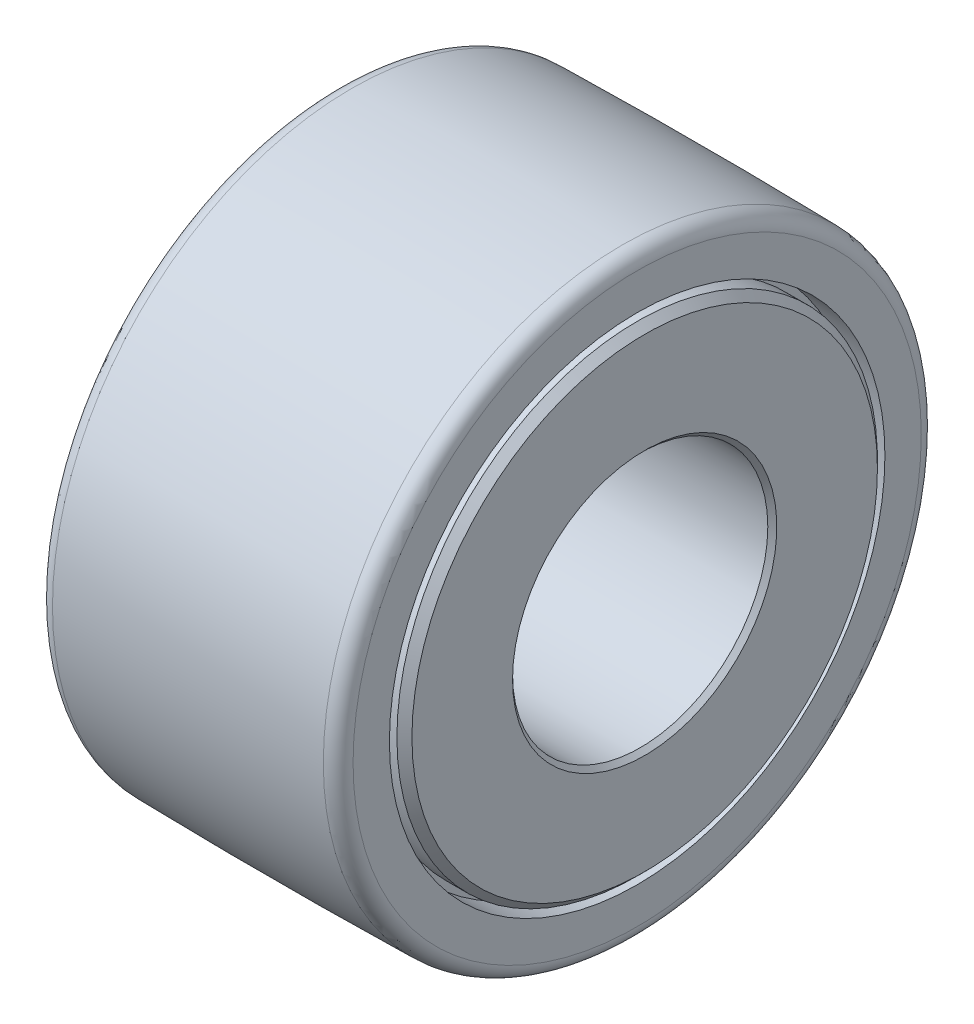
ISO-10303-21;
HEADER;
FILE_DESCRIPTION(('STEP AP214'),'2;1');
FILE_NAME('part.step','',(''),(''),'','','');
FILE_SCHEMA(('AUTOMOTIVE_DESIGN { 1 0 10303 214 1 1 1 1 }'));
ENDSEC;
DATA;
#1=APPLICATION_CONTEXT('core data for automotive mechanical design processes');
#2=APPLICATION_PROTOCOL_DEFINITION('international standard','automotive_design',2000,#1);
#3=PRODUCT_CONTEXT('',#1,'mechanical');
#4=PRODUCT('Part','Part','',(#3));
#5=PRODUCT_RELATED_PRODUCT_CATEGORY('part','',(#4));
#6=PRODUCT_DEFINITION_FORMATION('','',#4);
#7=PRODUCT_DEFINITION_CONTEXT('part definition',#1,'design');
#8=PRODUCT_DEFINITION('design','',#6,#7);
#9=PRODUCT_DEFINITION_SHAPE('','',#8);
#10=(LENGTH_UNIT() NAMED_UNIT(*) SI_UNIT(.MILLI.,.METRE.));
#11=(NAMED_UNIT(*) PLANE_ANGLE_UNIT() SI_UNIT($,.RADIAN.));
#12=(NAMED_UNIT(*) SI_UNIT($,.STERADIAN.) SOLID_ANGLE_UNIT());
#13=UNCERTAINTY_MEASURE_WITH_UNIT(LENGTH_MEASURE(1.E-05),#10,'distance_accuracy_value','');
#14=(GEOMETRIC_REPRESENTATION_CONTEXT(3) GLOBAL_UNCERTAINTY_ASSIGNED_CONTEXT((#13)) GLOBAL_UNIT_ASSIGNED_CONTEXT((#10,
#11,#12)) REPRESENTATION_CONTEXT('',''));
#15=CARTESIAN_POINT('',(0.,0.,0.));
#16=DIRECTION('',(0.,0.,1.));
#17=DIRECTION('',(1.,0.,0.));
#18=AXIS2_PLACEMENT_3D('',#15,#16,#17);
#19=CARTESIAN_POINT('',(10.5,0.,0.));
#20=DIRECTION('',(-1.,0.,0.));
#21=DIRECTION('',(0.,0.,1.));
#22=AXIS2_PLACEMENT_3D('',#19,#20,#21);
#23=DEGENERATE_TOROIDAL_SURFACE('',#22,480.,500.,.F.);
#24=CARTESIAN_POINT('',(1.48196392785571,0.,0.));
#25=DIRECTION('',(1.,0.,0.));
#26=DIRECTION('',(0.,0.,-1.));
#27=AXIS2_PLACEMENT_3D('',#24,#25,#26);
#28=CIRCLE('',#27,19.918668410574);
#29=CARTESIAN_POINT('',(1.48196392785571,0.,-19.918668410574));
#30=VERTEX_POINT('',#29);
#31=EDGE_CURVE('E21',#30,#30,#28,.T.);
#32=ORIENTED_EDGE('',*,*,#31,.T.);
#33=EDGE_LOOP('',(#32));
#34=FACE_BOUND('',#33,.T.);
#35=CARTESIAN_POINT('',(19.5180360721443,0.,0.));
#36=DIRECTION('',(-1.,0.,0.));
#37=DIRECTION('',(0.,0.,1.));
#38=AXIS2_PLACEMENT_3D('',#35,#36,#37);
#39=CIRCLE('',#38,19.918668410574);
#40=CARTESIAN_POINT('',(19.5180360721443,0.,19.918668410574));
#41=VERTEX_POINT('',#40);
#42=EDGE_CURVE('E25',#41,#41,#39,.T.);
#43=ORIENTED_EDGE('',*,*,#42,.T.);
#44=EDGE_LOOP('',(#43));
#45=FACE_BOUND('',#44,.T.);
#46=ADVANCED_FACE('F14',(#34,#45),#23,.F.);
#47=CARTESIAN_POINT('',(20.5,16.5,0.));
#48=DIRECTION('',(-1.,0.,0.));
#49=DIRECTION('',(0.,0.,1.));
#50=AXIS2_PLACEMENT_3D('',#47,#48,#49);
#51=PLANE('',#50);
#52=CARTESIAN_POINT('',(20.5,0.,0.));
#53=DIRECTION('',(-1.,0.,0.));
#54=DIRECTION('',(0.,0.,1.));
#55=AXIS2_PLACEMENT_3D('',#52,#53,#54);
#56=CIRCLE('',#55,18.9188310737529);
#57=CARTESIAN_POINT('',(20.5,0.,18.9188310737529));
#58=VERTEX_POINT('',#57);
#59=EDGE_CURVE('E10',#58,#58,#56,.F.);
#60=ORIENTED_EDGE('',*,*,#59,.T.);
#61=EDGE_LOOP('',(#60));
#62=FACE_BOUND('',#61,.T.);
#63=CARTESIAN_POINT('',(20.5,0.,0.));
#64=DIRECTION('',(-1.,0.,0.));
#65=DIRECTION('',(0.,0.,1.));
#66=AXIS2_PLACEMENT_3D('',#63,#64,#65);
#67=CIRCLE('',#66,16.5);
#68=CARTESIAN_POINT('',(20.5,0.,16.5));
#69=VERTEX_POINT('',#68);
#70=EDGE_CURVE('E58',#69,#69,#67,.T.);
#71=ORIENTED_EDGE('',*,*,#70,.T.);
#72=EDGE_LOOP('',(#71));
#73=FACE_BOUND('',#72,.T.);
#74=ADVANCED_FACE('F109',(#62,#73),#51,.F.);
#75=CARTESIAN_POINT('',(0.,0.,0.));
#76=DIRECTION('',(-1.,0.,0.));
#77=DIRECTION('',(0.,0.,1.));
#78=AXIS2_PLACEMENT_3D('',#75,#76,#77);
#79=CYLINDRICAL_SURFACE('',#78,16.5);
#80=ORIENTED_EDGE('',*,*,#70,.F.);
#81=EDGE_LOOP('',(#80));
#82=FACE_BOUND('',#81,.T.);
#83=CARTESIAN_POINT('',(18.5,0.,0.));
#84=DIRECTION('',(-1.,0.,0.));
#85=DIRECTION('',(0.,0.,1.));
#86=AXIS2_PLACEMENT_3D('',#83,#84,#85);
#87=CIRCLE('',#86,16.5);
#88=CARTESIAN_POINT('',(18.5,0.,16.5));
#89=VERTEX_POINT('',#88);
#90=EDGE_CURVE('E61',#89,#89,#87,.T.);
#91=ORIENTED_EDGE('',*,*,#90,.T.);
#92=EDGE_LOOP('',(#91));
#93=FACE_BOUND('',#92,.T.);
#94=ADVANCED_FACE('F115',(#82,#93),#79,.F.);
#95=CARTESIAN_POINT('',(18.5,11.5,0.));
#96=DIRECTION('',(-1.,0.,0.));
#97=DIRECTION('',(0.,0.,1.));
#98=AXIS2_PLACEMENT_3D('',#95,#96,#97);
#99=PLANE('',#98);
#100=ORIENTED_EDGE('',*,*,#90,.F.);
#101=EDGE_LOOP('',(#100));
#102=FACE_BOUND('',#101,.T.);
#103=CARTESIAN_POINT('',(18.5,0.,0.));
#104=DIRECTION('',(-1.,0.,0.));
#105=DIRECTION('',(0.,0.,1.));
#106=AXIS2_PLACEMENT_3D('',#103,#104,#105);
#107=CIRCLE('',#106,11.5);
#108=CARTESIAN_POINT('',(18.5,0.,11.5));
#109=VERTEX_POINT('',#108);
#110=EDGE_CURVE('E64',#109,#109,#107,.T.);
#111=ORIENTED_EDGE('',*,*,#110,.T.);
#112=EDGE_LOOP('',(#111));
#113=FACE_BOUND('',#112,.T.);
#114=ADVANCED_FACE('F229',(#102,#113),#99,.F.);
#115=CARTESIAN_POINT('',(0.,0.,0.));
#116=DIRECTION('',(-1.,0.,0.));
#117=DIRECTION('',(0.,0.,1.));
#118=AXIS2_PLACEMENT_3D('',#115,#116,#117);
#119=CYLINDRICAL_SURFACE('',#118,11.5);
#120=ORIENTED_EDGE('',*,*,#110,.F.);
#121=EDGE_LOOP('',(#120));
#122=FACE_BOUND('',#121,.T.);
#123=CARTESIAN_POINT('',(19.,0.,0.));
#124=DIRECTION('',(-1.,0.,0.));
#125=DIRECTION('',(0.,0.,1.));
#126=AXIS2_PLACEMENT_3D('',#123,#124,#125);
#127=CIRCLE('',#126,11.5);
#128=CARTESIAN_POINT('',(19.,0.,11.5));
#129=VERTEX_POINT('',#128);
#130=EDGE_CURVE('E67',#129,#129,#127,.T.);
#131=ORIENTED_EDGE('',*,*,#130,.T.);
#132=EDGE_LOOP('',(#131));
#133=FACE_BOUND('',#132,.T.);
#134=ADVANCED_FACE('F221',(#122,#133),#119,.T.);
#135=CARTESIAN_POINT('',(19.,16.,0.));
#136=DIRECTION('',(1.,0.,0.));
#137=DIRECTION('',(0.,0.,-1.));
#138=AXIS2_PLACEMENT_3D('',#135,#136,#137);
#139=PLANE('',#138);
#140=ORIENTED_EDGE('',*,*,#130,.F.);
#141=EDGE_LOOP('',(#140));
#142=FACE_BOUND('',#141,.T.);
#143=CARTESIAN_POINT('',(19.,0.,0.));
#144=DIRECTION('',(-1.,0.,0.));
#145=DIRECTION('',(0.,0.,1.));
#146=AXIS2_PLACEMENT_3D('',#143,#144,#145);
#147=CIRCLE('',#146,16.);
#148=CARTESIAN_POINT('',(19.,0.,16.));
#149=VERTEX_POINT('',#148);
#150=EDGE_CURVE('E70',#149,#149,#147,.T.);
#151=ORIENTED_EDGE('',*,*,#150,.T.);
#152=EDGE_LOOP('',(#151));
#153=FACE_BOUND('',#152,.T.);
#154=ADVANCED_FACE('F213',(#142,#153),#139,.F.);
#155=CARTESIAN_POINT('',(0.,0.,0.));
#156=DIRECTION('',(-1.,0.,0.));
#157=DIRECTION('',(0.,0.,1.));
#158=AXIS2_PLACEMENT_3D('',#155,#156,#157);
#159=CYLINDRICAL_SURFACE('',#158,16.);
#160=CARTESIAN_POINT('',(20.5,0.,0.));
#161=DIRECTION('',(-1.,0.,0.));
#162=DIRECTION('',(0.,0.,1.));
#163=AXIS2_PLACEMENT_3D('',#160,#161,#162);
#164=CIRCLE('',#163,16.);
#165=CARTESIAN_POINT('',(20.5,0.,16.));
#166=VERTEX_POINT('',#165);
#167=EDGE_CURVE('E55',#166,#166,#164,.T.);
#168=ORIENTED_EDGE('',*,*,#167,.T.);
#169=EDGE_LOOP('',(#168));
#170=FACE_BOUND('',#169,.T.);
#171=ORIENTED_EDGE('',*,*,#150,.F.);
#172=EDGE_LOOP('',(#171));
#173=FACE_BOUND('',#172,.T.);
#174=ADVANCED_FACE('F205',(#170,#173),#159,.T.);
#175=CARTESIAN_POINT('',(21.,8.5,0.));
#176=DIRECTION('',(-1.,0.,0.));
#177=DIRECTION('',(0.,0.,1.));
#178=AXIS2_PLACEMENT_3D('',#175,#176,#177);
#179=PLANE('',#178);
#180=CARTESIAN_POINT('',(21.,0.,0.));
#181=DIRECTION('',(-1.,0.,0.));
#182=DIRECTION('',(0.,0.,1.));
#183=AXIS2_PLACEMENT_3D('',#180,#181,#182);
#184=CIRCLE('',#183,8.8);
#185=CARTESIAN_POINT('',(21.,0.,8.8));
#186=VERTEX_POINT('',#185);
#187=EDGE_CURVE('E43',#186,#186,#184,.T.);
#188=ORIENTED_EDGE('',*,*,#187,.T.);
#189=EDGE_LOOP('',(#188));
#190=FACE_BOUND('',#189,.T.);
#191=CARTESIAN_POINT('',(21.,0.,0.));
#192=DIRECTION('',(-1.,0.,0.));
#193=DIRECTION('',(0.,0.,1.));
#194=AXIS2_PLACEMENT_3D('',#191,#192,#193);
#195=CIRCLE('',#194,15.5);
#196=CARTESIAN_POINT('',(21.,0.,15.5));
#197=VERTEX_POINT('',#196);
#198=EDGE_CURVE('E52',#197,#197,#195,.F.);
#199=ORIENTED_EDGE('',*,*,#198,.T.);
#200=EDGE_LOOP('',(#199));
#201=FACE_BOUND('',#200,.T.);
#202=ADVANCED_FACE('F197',(#190,#201),#179,.F.);
#203=CARTESIAN_POINT('',(0.,0.,0.));
#204=DIRECTION('',(-1.,0.,0.));
#205=DIRECTION('',(0.,0.,1.));
#206=AXIS2_PLACEMENT_3D('',#203,#204,#205);
#207=CYLINDRICAL_SURFACE('',#206,8.5);
#208=CARTESIAN_POINT('',(20.7,0.,0.));
#209=DIRECTION('',(-1.,0.,0.));
#210=DIRECTION('',(0.,0.,1.));
#211=AXIS2_PLACEMENT_3D('',#208,#209,#210);
#212=CIRCLE('',#211,8.5);
#213=CARTESIAN_POINT('',(20.7,0.,8.5));
#214=VERTEX_POINT('',#213);
#215=EDGE_CURVE('E37',#214,#214,#212,.F.);
#216=ORIENTED_EDGE('',*,*,#215,.T.);
#217=EDGE_LOOP('',(#216));
#218=FACE_BOUND('',#217,.T.);
#219=CARTESIAN_POINT('',(0.300000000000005,0.,0.));
#220=DIRECTION('',(1.,0.,0.));
#221=DIRECTION('',(0.,0.,-1.));
#222=AXIS2_PLACEMENT_3D('',#219,#220,#221);
#223=CIRCLE('',#222,8.5);
#224=CARTESIAN_POINT('',(0.300000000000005,0.,-8.5));
#225=VERTEX_POINT('',#224);
#226=EDGE_CURVE('E40',#225,#225,#223,.F.);
#227=ORIENTED_EDGE('',*,*,#226,.T.);
#228=EDGE_LOOP('',(#227));
#229=FACE_BOUND('',#228,.T.);
#230=ADVANCED_FACE('F189',(#218,#229),#207,.F.);
#231=CARTESIAN_POINT('',(0.,8.5,0.));
#232=DIRECTION('',(1.,0.,0.));
#233=DIRECTION('',(0.,0.,-1.));
#234=AXIS2_PLACEMENT_3D('',#231,#232,#233);
#235=PLANE('',#234);
#236=CARTESIAN_POINT('',(0.,0.,0.));
#237=DIRECTION('',(1.,0.,0.));
#238=DIRECTION('',(0.,0.,-1.));
#239=AXIS2_PLACEMENT_3D('',#236,#237,#238);
#240=CIRCLE('',#239,8.8);
#241=CARTESIAN_POINT('',(0.,0.,-8.8));
#242=VERTEX_POINT('',#241);
#243=EDGE_CURVE('E34',#242,#242,#240,.T.);
#244=ORIENTED_EDGE('',*,*,#243,.T.);
#245=EDGE_LOOP('',(#244));
#246=FACE_BOUND('',#245,.T.);
#247=CARTESIAN_POINT('',(0.,0.,0.));
#248=DIRECTION('',(1.,0.,0.));
#249=DIRECTION('',(0.,0.,-1.));
#250=AXIS2_PLACEMENT_3D('',#247,#248,#249);
#251=CIRCLE('',#250,15.5);
#252=CARTESIAN_POINT('',(0.,0.,-15.5));
#253=VERTEX_POINT('',#252);
#254=EDGE_CURVE('E49',#253,#253,#251,.F.);
#255=ORIENTED_EDGE('',*,*,#254,.T.);
#256=EDGE_LOOP('',(#255));
#257=FACE_BOUND('',#256,.T.);
#258=ADVANCED_FACE('F181',(#246,#257),#235,.F.);
#259=CARTESIAN_POINT('',(0.,0.,0.));
#260=DIRECTION('',(-1.,0.,0.));
#261=DIRECTION('',(0.,0.,1.));
#262=AXIS2_PLACEMENT_3D('',#259,#260,#261);
#263=CYLINDRICAL_SURFACE('',#262,16.);
#264=CARTESIAN_POINT('',(0.5,0.,0.));
#265=DIRECTION('',(1.,0.,0.));
#266=DIRECTION('',(0.,0.,-1.));
#267=AXIS2_PLACEMENT_3D('',#264,#265,#266);
#268=CIRCLE('',#267,16.);
#269=CARTESIAN_POINT('',(0.5,0.,-16.));
#270=VERTEX_POINT('',#269);
#271=EDGE_CURVE('E46',#270,#270,#268,.T.);
#272=ORIENTED_EDGE('',*,*,#271,.T.);
#273=EDGE_LOOP('',(#272));
#274=FACE_BOUND('',#273,.T.);
#275=CARTESIAN_POINT('',(2.,0.,0.));
#276=DIRECTION('',(-1.,0.,0.));
#277=DIRECTION('',(0.,0.,1.));
#278=AXIS2_PLACEMENT_3D('',#275,#276,#277);
#279=CIRCLE('',#278,16.);
#280=CARTESIAN_POINT('',(2.,0.,16.));
#281=VERTEX_POINT('',#280);
#282=EDGE_CURVE('E73',#281,#281,#279,.T.);
#283=ORIENTED_EDGE('',*,*,#282,.T.);
#284=EDGE_LOOP('',(#283));
#285=FACE_BOUND('',#284,.T.);
#286=ADVANCED_FACE('F173',(#274,#285),#263,.T.);
#287=CARTESIAN_POINT('',(2.,16.,0.));
#288=DIRECTION('',(-1.,0.,0.));
#289=DIRECTION('',(0.,0.,1.));
#290=AXIS2_PLACEMENT_3D('',#287,#288,#289);
#291=PLANE('',#290);
#292=ORIENTED_EDGE('',*,*,#282,.F.);
#293=EDGE_LOOP('',(#292));
#294=FACE_BOUND('',#293,.T.);
#295=CARTESIAN_POINT('',(2.,0.,0.));
#296=DIRECTION('',(-1.,0.,0.));
#297=DIRECTION('',(0.,0.,1.));
#298=AXIS2_PLACEMENT_3D('',#295,#296,#297);
#299=CIRCLE('',#298,11.5);
#300=CARTESIAN_POINT('',(2.,0.,11.5));
#301=VERTEX_POINT('',#300);
#302=EDGE_CURVE('E76',#301,#301,#299,.T.);
#303=ORIENTED_EDGE('',*,*,#302,.T.);
#304=EDGE_LOOP('',(#303));
#305=FACE_BOUND('',#304,.T.);
#306=ADVANCED_FACE('F165',(#294,#305),#291,.F.);
#307=CARTESIAN_POINT('',(0.,0.,0.));
#308=DIRECTION('',(-1.,0.,0.));
#309=DIRECTION('',(0.,0.,1.));
#310=AXIS2_PLACEMENT_3D('',#307,#308,#309);
#311=CYLINDRICAL_SURFACE('',#310,11.5);
#312=ORIENTED_EDGE('',*,*,#302,.F.);
#313=EDGE_LOOP('',(#312));
#314=FACE_BOUND('',#313,.T.);
#315=CARTESIAN_POINT('',(2.5,0.,0.));
#316=DIRECTION('',(-1.,0.,0.));
#317=DIRECTION('',(0.,0.,1.));
#318=AXIS2_PLACEMENT_3D('',#315,#316,#317);
#319=CIRCLE('',#318,11.5);
#320=CARTESIAN_POINT('',(2.5,0.,11.5));
#321=VERTEX_POINT('',#320);
#322=EDGE_CURVE('E79',#321,#321,#319,.T.);
#323=ORIENTED_EDGE('',*,*,#322,.T.);
#324=EDGE_LOOP('',(#323));
#325=FACE_BOUND('',#324,.T.);
#326=ADVANCED_FACE('F157',(#314,#325),#311,.T.);
#327=CARTESIAN_POINT('',(2.5,11.5,0.));
#328=DIRECTION('',(1.,0.,0.));
#329=DIRECTION('',(0.,0.,-1.));
#330=AXIS2_PLACEMENT_3D('',#327,#328,#329);
#331=PLANE('',#330);
#332=ORIENTED_EDGE('',*,*,#322,.F.);
#333=EDGE_LOOP('',(#332));
#334=FACE_BOUND('',#333,.T.);
#335=CARTESIAN_POINT('',(2.5,0.,0.));
#336=DIRECTION('',(-1.,0.,0.));
#337=DIRECTION('',(0.,0.,1.));
#338=AXIS2_PLACEMENT_3D('',#335,#336,#337);
#339=CIRCLE('',#338,16.5);
#340=CARTESIAN_POINT('',(2.5,0.,16.5));
#341=VERTEX_POINT('',#340);
#342=EDGE_CURVE('E82',#341,#341,#339,.T.);
#343=ORIENTED_EDGE('',*,*,#342,.T.);
#344=EDGE_LOOP('',(#343));
#345=FACE_BOUND('',#344,.T.);
#346=ADVANCED_FACE('F105',(#334,#345),#331,.F.);
#347=CARTESIAN_POINT('',(0.,0.,0.));
#348=DIRECTION('',(-1.,0.,0.));
#349=DIRECTION('',(0.,0.,1.));
#350=AXIS2_PLACEMENT_3D('',#347,#348,#349);
#351=CYLINDRICAL_SURFACE('',#350,16.5);
#352=ORIENTED_EDGE('',*,*,#342,.F.);
#353=EDGE_LOOP('',(#352));
#354=FACE_BOUND('',#353,.T.);
#355=CARTESIAN_POINT('',(0.5,0.,0.));
#356=DIRECTION('',(-1.,0.,0.));
#357=DIRECTION('',(0.,0.,1.));
#358=AXIS2_PLACEMENT_3D('',#355,#356,#357);
#359=CIRCLE('',#358,16.5);
#360=CARTESIAN_POINT('',(0.5,0.,16.5));
#361=VERTEX_POINT('',#360);
#362=EDGE_CURVE('E85',#361,#361,#359,.T.);
#363=ORIENTED_EDGE('',*,*,#362,.T.);
#364=EDGE_LOOP('',(#363));
#365=FACE_BOUND('',#364,.T.);
#366=ADVANCED_FACE('F89',(#354,#365),#351,.F.);
#367=CARTESIAN_POINT('',(0.5,16.5,0.));
#368=DIRECTION('',(1.,0.,0.));
#369=DIRECTION('',(0.,0.,-1.));
#370=AXIS2_PLACEMENT_3D('',#367,#368,#369);
#371=PLANE('',#370);
#372=CARTESIAN_POINT('',(0.5,0.,0.));
#373=DIRECTION('',(1.,0.,0.));
#374=DIRECTION('',(0.,0.,-1.));
#375=AXIS2_PLACEMENT_3D('',#372,#373,#374);
#376=CIRCLE('',#375,18.9188310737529);
#377=CARTESIAN_POINT('',(0.5,0.,-18.9188310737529));
#378=VERTEX_POINT('',#377);
#379=EDGE_CURVE('E29',#378,#378,#376,.F.);
#380=ORIENTED_EDGE('',*,*,#379,.T.);
#381=EDGE_LOOP('',(#380));
#382=FACE_BOUND('',#381,.T.);
#383=ORIENTED_EDGE('',*,*,#362,.F.);
#384=EDGE_LOOP('',(#383));
#385=FACE_BOUND('',#384,.T.);
#386=ADVANCED_FACE('F91',(#382,#385),#371,.F.);
#387=CARTESIAN_POINT('',(20.5,0.,0.));
#388=DIRECTION('',(-1.,0.,0.));
#389=DIRECTION('',(0.,0.,1.));
#390=AXIS2_PLACEMENT_3D('',#387,#388,#389);
#391=CONICAL_SURFACE('',#390,16.,0.785398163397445);
#392=ORIENTED_EDGE('',*,*,#198,.F.);
#393=EDGE_LOOP('',(#392));
#394=FACE_BOUND('',#393,.T.);
#395=ORIENTED_EDGE('',*,*,#167,.F.);
#396=EDGE_LOOP('',(#395));
#397=FACE_BOUND('',#396,.T.);
#398=ADVANCED_FACE('F93',(#394,#397),#391,.T.);
#399=CARTESIAN_POINT('',(0.,0.,0.));
#400=DIRECTION('',(1.,0.,0.));
#401=DIRECTION('',(0.,0.,-1.));
#402=AXIS2_PLACEMENT_3D('',#399,#400,#401);
#403=CONICAL_SURFACE('',#402,15.5,0.785398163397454);
#404=ORIENTED_EDGE('',*,*,#271,.F.);
#405=EDGE_LOOP('',(#404));
#406=FACE_BOUND('',#405,.T.);
#407=ORIENTED_EDGE('',*,*,#254,.F.);
#408=EDGE_LOOP('',(#407));
#409=FACE_BOUND('',#408,.T.);
#410=ADVANCED_FACE('F102',(#406,#409),#403,.T.);
#411=CARTESIAN_POINT('',(21.,0.,0.));
#412=DIRECTION('',(1.,0.,0.));
#413=DIRECTION('',(0.,0.,-1.));
#414=AXIS2_PLACEMENT_3D('',#411,#412,#413);
#415=CONICAL_SURFACE('',#414,8.8,0.785398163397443);
#416=ORIENTED_EDGE('',*,*,#215,.F.);
#417=EDGE_LOOP('',(#416));
#418=FACE_BOUND('',#417,.T.);
#419=ORIENTED_EDGE('',*,*,#187,.F.);
#420=EDGE_LOOP('',(#419));
#421=FACE_BOUND('',#420,.T.);
#422=ADVANCED_FACE('F122',(#418,#421),#415,.F.);
#423=CARTESIAN_POINT('',(0.300000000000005,0.,0.));
#424=DIRECTION('',(-1.,0.,0.));
#425=DIRECTION('',(0.,0.,1.));
#426=AXIS2_PLACEMENT_3D('',#423,#424,#425);
#427=CONICAL_SURFACE('',#426,8.5,0.785398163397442);
#428=ORIENTED_EDGE('',*,*,#243,.F.);
#429=EDGE_LOOP('',(#428));
#430=FACE_BOUND('',#429,.T.);
#431=ORIENTED_EDGE('',*,*,#226,.F.);
#432=EDGE_LOOP('',(#431));
#433=FACE_BOUND('',#432,.T.);
#434=ADVANCED_FACE('F126',(#430,#433),#427,.F.);
#435=CARTESIAN_POINT('',(1.5,0.,0.));
#436=DIRECTION('',(1.,0.,0.));
#437=DIRECTION('',(0.,0.,-1.));
#438=AXIS2_PLACEMENT_3D('',#435,#436,#437);
#439=TOROIDAL_SURFACE('',#438,18.9188310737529,1.);
#440=ORIENTED_EDGE('',*,*,#31,.F.);
#441=EDGE_LOOP('',(#440));
#442=FACE_BOUND('',#441,.T.);
#443=ORIENTED_EDGE('',*,*,#379,.F.);
#444=EDGE_LOOP('',(#443));
#445=FACE_BOUND('',#444,.T.);
#446=ADVANCED_FACE('F129',(#442,#445),#439,.T.);
#447=CARTESIAN_POINT('',(19.5,0.,0.));
#448=DIRECTION('',(-1.,0.,0.));
#449=DIRECTION('',(0.,0.,1.));
#450=AXIS2_PLACEMENT_3D('',#447,#448,#449);
#451=TOROIDAL_SURFACE('',#450,18.9188310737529,1.);
#452=ORIENTED_EDGE('',*,*,#59,.F.);
#453=EDGE_LOOP('',(#452));
#454=FACE_BOUND('',#453,.T.);
#455=ORIENTED_EDGE('',*,*,#42,.F.);
#456=EDGE_LOOP('',(#455));
#457=FACE_BOUND('',#456,.T.);
#458=ADVANCED_FACE('F16',(#454,#457),#451,.T.);
#459=CLOSED_SHELL('',(#46,#74,#94,#114,#134,#154,#174,#202,#230,#258,#286,#306,#326,#346,#366,
#386,#398,#410,#422,#434,#446,#458));
#460=MANIFOLD_SOLID_BREP('B1',#459);
#461=ADVANCED_BREP_SHAPE_REPRESENTATION('',(#18,#460),#14);
#462=SHAPE_DEFINITION_REPRESENTATION(#9,#461);
ENDSEC;
END-ISO-10303-21;
